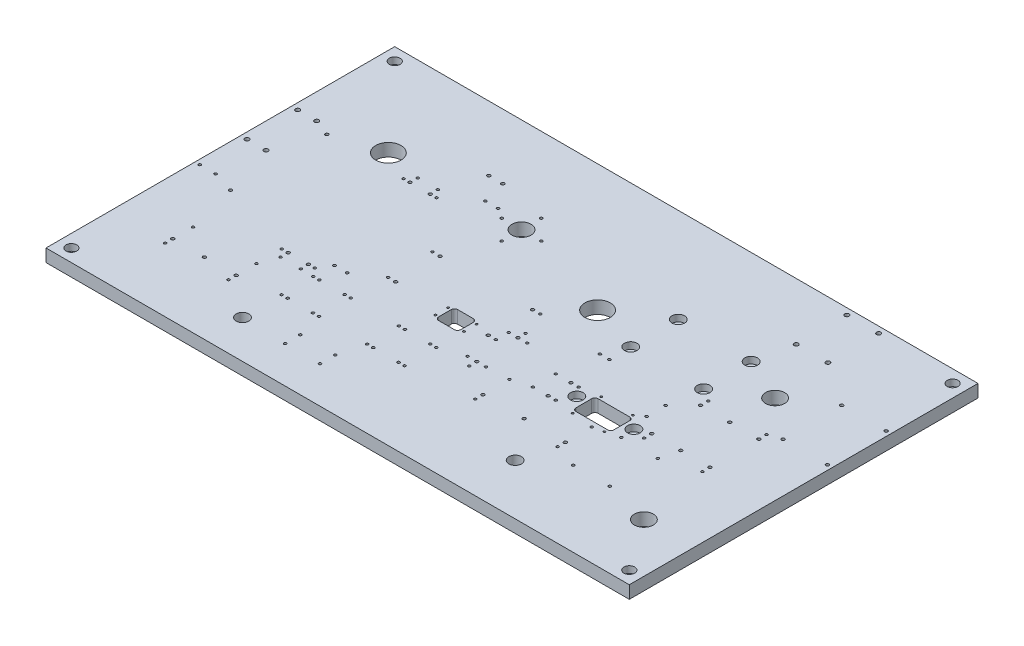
from build123d import *

# Parameters (mm, degrees)
SKETCH_1_W          = 920
SKETCH_1_H          = 20
EXTRUDE_1_DEPTH     = 550
SKETCH_2_R          = 2.1
SKETCH_2_R_2        = 2.5
SKETCH_2_R_3        = 3.25
SKETCH_2_R_4        = 3.375
SKETCH_2_R_5        = 1.65
SKETCH_2_R_6        = 15
SKETCH_2_R_7        = 2
SKETCH_2_R_8        = 5.25
SKETCH_2_R_9        = 10
SKETCH_2_R_10       = 20
CUT_EXTRUDE_2_DEPTH = 550
SKETCH_3_R          = 2
CUT_EXTRUDE_3_DEPTH = 550
SKETCH_4_R          = 8.5
CUT_EXTRUDE_4_DEPTH = 10.5
SKETCH_5_R          = 10
CUT_EXTRUDE_5_DEPTH = 10.5
SKETCH_7_R          = 5.5
SKETCH_7_R_2        = 5.456903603
CUT_EXTRUDE_6_DEPTH = 6.5


with BuildPart() as part:
    # Sketch 1 → Extrude 1 (new body)
    with BuildSketch(Plane.XY):
        with Locations((460, 10)):
            Rectangle(SKETCH_1_W, SKETCH_1_H)
    extrude(amount=EXTRUDE_1_DEPTH)

    # Sketch 2 → Cut-Extrude 2 (cut)
    with BuildSketch(Plane(origin=(0, 20, 0), x_dir=(1, 0, 0), z_dir=(0, 1, 0))):
        with Locations(Location((32.5, -315, 0), (0, 0, 270))):
            Circle(SKETCH_2_R)
        with Locations(Location((7.5, -315, 0), (0, 0, 270))):
            Circle(SKETCH_2_R)
        with Locations(Location((66.45, -325.428369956, 0), (0, 0, 270))):
            Circle(SKETCH_2_R_2)
        with Locations(Location((66.45, -173.428369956, 0), (0, 0, 270))):
            Circle(SKETCH_2_R_2)
        with Locations(Location((229.45, -173.428369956, 0), (0, 0, 270))):
            Circle(SKETCH_2_R_2)
        with Locations(Location((197.45, -173.428369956, 0), (0, 0, 270))):
            Circle(SKETCH_2_R_2)
        with Locations(Location((229.45, -365.5, 0), (0, 0, 270))):
            Circle(SKETCH_2_R_2)
        with Locations(Location((197.45, -365.5, 0), (0, 0, 270))):
            Circle(SKETCH_2_R_2)
        with Locations(Location((272.45, -102, 0), (0, 0, 270))):
            Circle(SKETCH_2_R_2)
        with Locations(Location((250.45, -102, 0), (0, 0, 270))):
            Circle(SKETCH_2_R_2)
        with Locations(Location((302.45, -139.428369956, 0), (0, 0, 270))):
            Circle(SKETCH_2_R)
        with Locations(Location((282.45, -139.428369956, 0), (0, 0, 270))):
            Circle(SKETCH_2_R)
        with Locations(Location((251.45, -346.428369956, 0), (0, 0, 270))):
            Circle(SKETCH_2_R)
        with Locations(Location((271.45, -346.428369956, 0), (0, 0, 270))):
            Circle(SKETCH_2_R)
        with Locations(Location((322, -250.5, 0), (0, 0, 270))):
            Circle(SKETCH_2_R_2)
        with Locations(Location((322, -320.5, 0), (0, 0, 270))):
            Circle(SKETCH_2_R_2)
        with Locations(Location((468, -250.5, 0), (0, 0, 270))):
            Circle(SKETCH_2_R_2)
        with Locations(Location((468, -320.5, 0), (0, 0, 270))):
            Circle(SKETCH_2_R_2)
        with Locations(Location((494.9, -300.5, 0), (0, 0, 270))):
            Circle(SKETCH_2_R_2)
        with Locations(Location((494.9, -365.5, 0), (0, 0, 270))):
            Circle(SKETCH_2_R_2)
        with Locations(Location((598, -320, 0), (0, 0, 270))):
            Circle(SKETCH_2_R_2)
        with Locations(Location((598, -356, 0), (0, 0, 270))):
            Circle(SKETCH_2_R_2)
        with Locations(Location((731.25, -248.8, 0), (0, 0, 270))):
            Circle(SKETCH_2_R_2)
        with Locations(Location((777.25, -248.8, 0), (0, 0, 270))):
            Circle(SKETCH_2_R_2)
        with Locations(Location((823.25, -248.8, 0), (0, 0, 270))):
            Circle(SKETCH_2_R_2)
        with Locations(Location((823.25, -326, 0), (0, 0, 270))):
            Circle(SKETCH_2_R_2)
        with Locations(Location((777.25, -326, 0), (0, 0, 270))):
            Circle(SKETCH_2_R_2)
        with Locations(Location((731.25, -326, 0), (0, 0, 270))):
            Circle(SKETCH_2_R_2)
        with Locations(Location((842.5, -230, 0), (0, 0, 270))):
            Circle(SKETCH_2_R_2)
        with Locations(Location((912.5, -230, 0), (0, 0, 270))):
            Circle(SKETCH_2_R_2)
        with Locations(Location((912.5, -137.5, 0), (0, 0, 270))):
            Circle(SKETCH_2_R_2)
        with Locations(Location((842.5, -137.5, 0), (0, 0, 270))):
            Circle(SKETCH_2_R_2)
        with Locations(Location((770, -355, 0), (0, 0, 270))):
            Circle(SKETCH_2_R)
        with Locations(Location((712.5, -355, 0), (0, 0, 270))):
            Circle(SKETCH_2_R)
        with Locations(Location((770, -431, 0), (0, 0, 270))):
            Circle(SKETCH_2_R)
        with Locations(Location((712.5, -431, 0), (0, 0, 270))):
            Circle(SKETCH_2_R)
        with Locations(Location((675, -406, 0), (0, 0, 270))):
            Circle(SKETCH_2_R_2)
        with Locations(Location((610, -406, 0), (0, 0, 270))):
            Circle(SKETCH_2_R_2)
        with Locations(Location((545, -406, 0), (0, 0, 270))):
            Circle(SKETCH_2_R_2)
        with Locations(Location((434.2, -428.1, 0), (0, 0, 270))):
            Circle(SKETCH_2_R)
        with Locations(Location((434.2, -378.1, 0), (0, 0, 270))):
            Circle(SKETCH_2_R)
        with Locations(Location((394.2, -378.1, 0), (0, 0, 270))):
            Circle(SKETCH_2_R)
        with Locations(Location((394.2, -428.1, 0), (0, 0, 270))):
            Circle(SKETCH_2_R)
        with Locations(Location((299.2, -378.1, 0), (0, 0, 270))):
            Circle(SKETCH_2_R)
        with Locations(Location((299.2, -428.1, 0), (0, 0, 270))):
            Circle(SKETCH_2_R)
        with Locations(Location((259.2, -428.1, 0), (0, 0, 270))):
            Circle(SKETCH_2_R)
        with Locations(Location((259.2, -378.1, 0), (0, 0, 270))):
            Circle(SKETCH_2_R)
        with Locations(Location((187.4, -437.5, 0), (0, 0, 270))):
            Circle(SKETCH_2_R_2)
        with Locations(Location((137.4, -437.5, 0), (0, 0, 270))):
            Circle(SKETCH_2_R_2)
        with Locations(Location((87.4, -437.5, 0), (0, 0, 270))):
            Circle(SKETCH_2_R_2)
        with Locations(Location((374.2, -468, 0), (0, 0, 270))):
            Circle(SKETCH_2_R)
        with Locations(Location((374.2, -492, 0), (0, 0, 270))):
            Circle(SKETCH_2_R)
        with Locations(Location((319.2, -492, 0), (0, 0, 270))):
            Circle(SKETCH_2_R)
        with Locations(Location((319.2, -468, 0), (0, 0, 270))):
            Circle(SKETCH_2_R)
        with Locations(Location((621.25, -334, 0), (0, 0, 270))):
            Circle(SKETCH_2_R_3)
        with Locations(Location((711.25, -334, 0), (0, 0, 270))):
            Circle(SKETCH_2_R_3)
        with Locations(Location((711.25, -224, 0), (0, 0, 270))):
            Circle(SKETCH_2_R_3)
        with Locations(Location((596.25, -224, 0), (0, 0, 270))):
            Circle(SKETCH_2_R_3)
        with Locations(Location((596.25, -149, 0), (0, 0, 270))):
            Circle(SKETCH_2_R_3)
        with Locations(Location((711.25, -149, 0), (0, 0, 270))):
            Circle(SKETCH_2_R_3)
        with Locations(Location((596.75, -258.081903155, 0), (0, 0, 270))):
            Circle(SKETCH_2_R)
        with Locations(Location((581.75, -258.081903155, 0), (0, 0, 270))):
            Circle(SKETCH_2_R)
        with Locations(Location((703.75, -276.5, 0), (0, 0, 270))):
            Circle(SKETCH_2_R)
        with Locations(Location((703.75, -306.5, 0), (0, 0, 270))):
            Circle(SKETCH_2_R)
        with Locations(Location((40, -163, 0), (0, 0, 270))):
            Circle(SKETCH_2_R_4)
        with Locations(Location((10, -163, 0), (0, 0, 270))):
            Circle(SKETCH_2_R_4)
        with Locations(Location((40, -243, 0), (0, 0, 270))):
            Circle(SKETCH_2_R_4)
        with Locations(Location((10, -243, 0), (0, 0, 270))):
            Circle(SKETCH_2_R_4)
        with Locations(Location((773.25, -90, 0), (0, 0, 270))):
            Circle(SKETCH_2_R_4)
        with Locations(Location((723.25, -90, 0), (0, 0, 270))):
            Circle(SKETCH_2_R_4)
        with Locations(Location((723.25, -10, 0), (0, 0, 270))):
            Circle(SKETCH_2_R_4)
        with Locations(Location((773.25, -10, 0), (0, 0, 270))):
            Circle(SKETCH_2_R_4)
        with Locations(Location((318.75, -150, 0), (0, 0, 270))):
            Circle(SKETCH_2_R)
        with Locations(Location((350, -181.25, 0), (0, 0, 270))):
            Circle(SKETCH_2_R)
        with Locations(Location((381.25, -150, 0), (0, 0, 270))):
            Circle(SKETCH_2_R)
        with Locations(Location((350, -118.75, 0), (0, 0, 270))):
            Circle(SKETCH_2_R)
        with Locations(Location((398.7, -314.5, 0), (0, 0, 270))):
            Circle(SKETCH_2_R_5)
        with Locations(Location((443.7, -314.5, 0), (0, 0, 270))):
            Circle(SKETCH_2_R_5)
        with Locations(Location((443.7, -334.5, 0), (0, 0, 270))):
            Circle(SKETCH_2_R_5)
        with Locations(Location((398.7, -334.5, 0), (0, 0, 270))):
            Circle(SKETCH_2_R_5)
        with Locations(Location((641.25, -360.5, 0), (0, 0, 270))):
            Circle(SKETCH_2_R_5)
        with Locations(Location((691.25, -360.5, 0), (0, 0, 270))):
            Circle(SKETCH_2_R_5)
        with Locations(Location((691.25, -315.5, 0), (0, 0, 270))):
            Circle(SKETCH_2_R_5)
        with Locations(Location((641.25, -315.5, 0), (0, 0, 270))):
            Circle(SKETCH_2_R_5)
        with Locations(Location((350, -150, 0), (0, 0, 270))):
            Circle(SKETCH_2_R_6)
        with Locations(Location((187.4, -405.5, 0), (0, 0, 270))):
            Circle(SKETCH_2_R_7)
        with Locations(Location((87.4, -405.5, 0), (0, 0, 270))):
            Circle(SKETCH_2_R_7)
        with Locations(Location((87.4, -449.5, 0), (0, 0, 270))):
            Circle(SKETCH_2_R_7)
        with Locations(Location((187.4, -449.5, 0), (0, 0, 270))):
            Circle(SKETCH_2_R_7)
        with Locations(Location((308.7, -378.1, 0), (0, 0, 270))):
            Circle(SKETCH_2_R_7)
        with Locations(Location((308.7, -428.1, 0), (0, 0, 270))):
            Circle(SKETCH_2_R_7)
        with Locations(Location((249.7, -428.1, 0), (0, 0, 270))):
            Circle(SKETCH_2_R_7)
        with Locations(Location((249.7, -378.1, 0), (0, 0, 270))):
            Circle(SKETCH_2_R_7)
        with Locations(Location((443.7, -428.1, 0), (0, 0, 270))):
            Circle(SKETCH_2_R_7)
        with Locations(Location((443.7, -378.1, 0), (0, 0, 270))):
            Circle(SKETCH_2_R_7)
        with Locations(Location((384.7, -378.1, 0), (0, 0, 270))):
            Circle(SKETCH_2_R_7)
        with Locations(Location((384.7, -428.1, 0), (0, 0, 270))):
            Circle(SKETCH_2_R_7)
        with Locations(Location((239.45, -365.5, 0), (0, 0, 270))):
            Circle(SKETCH_2_R_7)
        with Locations(Location((187.45, -365.5, 0), (0, 0, 270))):
            Circle(SKETCH_2_R_7)
        with Locations(Location((239.45, -173.428369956, 0), (0, 0, 270))):
            Circle(SKETCH_2_R_7)
        with Locations(Location((187.45, -173.428369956, 0), (0, 0, 270))):
            Circle(SKETCH_2_R_7)
        with Locations(Location((229.45, -377.5, 0), (0, 0, 270))):
            Circle(SKETCH_2_R_7)
        with Locations(Location((197.45, -377.5, 0), (0, 0, 270))):
            Circle(SKETCH_2_R_7)
        with Locations(Location((229.45, -161.428369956, 0), (0, 0, 270))):
            Circle(SKETCH_2_R_7)
        with Locations(Location((197.45, -161.428369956, 0), (0, 0, 270))):
            Circle(SKETCH_2_R_7)
        with Locations(Location((494.9, -288.5, 0), (0, 0, 270))):
            Circle(SKETCH_2_R_7)
        with Locations(Location((494.9, -377.5, 0), (0, 0, 270))):
            Circle(SKETCH_2_R_7)
        with Locations(Location((509.4, -300.5, 0), (0, 0, 270))):
            Circle(SKETCH_2_R_7)
        with Locations(Location((509.4, -365.5, 0), (0, 0, 270))):
            Circle(SKETCH_2_R_7)
        with Locations(Location((480.4, -365.5, 0), (0, 0, 270))):
            Circle(SKETCH_2_R_7)
        with Locations(Location((574, -356, 0), (0, 0, 270))):
            Circle(SKETCH_2_R_7)
        with Locations(Location((610, -356, 0), (0, 0, 270))):
            Circle(SKETCH_2_R_7)
        with Locations(Location((610, -320, 0), (0, 0, 270))):
            Circle(SKETCH_2_R_7)
        with Locations(Location((574, -320, 0), (0, 0, 270))):
            Circle(SKETCH_2_R_7)
        with Locations(Location((675, -418, 0), (0, 0, 270))):
            Circle(SKETCH_2_R_7)
        with Locations(Location((545, -418, 0), (0, 0, 270))):
            Circle(SKETCH_2_R_7)
        with Locations(Location((545, -364, 0), (0, 0, 270))):
            Circle(SKETCH_2_R_7)
        with Locations(Location((675, -364, 0), (0, 0, 270))):
            Circle(SKETCH_2_R_7)
        with Locations(Location((731.25, -236.8, 0), (0, 0, 270))):
            Circle(SKETCH_2_R_7)
        with Locations(Location((823.25, -236.8, 0), (0, 0, 270))):
            Circle(SKETCH_2_R_7)
        with Locations(Location((823.25, -338, 0), (0, 0, 270))):
            Circle(SKETCH_2_R_7)
        with Locations(Location((731.25, -338, 0), (0, 0, 270))):
            Circle(SKETCH_2_R_7)
        with Locations(Location((310, -320.5, 0), (0, 0, 270))):
            Circle(SKETCH_2_R_7)
        with Locations(Location((310, -250.5, 0), (0, 0, 270))):
            Circle(SKETCH_2_R_7)
        with Locations(Location((480, -250.5, 0), (0, 0, 270))):
            Circle(SKETCH_2_R_7)
        with Locations(Location((480, -320.5, 0), (0, 0, 270))):
            Circle(SKETCH_2_R_7)
        with Locations(Location((20, -530, 0), (0, 0, 270))):
            Circle(SKETCH_2_R_8)
        with Locations(Location((20, -20, 0), (0, 0, 270))):
            Circle(SKETCH_2_R_8)
        with Locations(Location((900, -20, 0), (0, 0, 270))):
            Circle(SKETCH_2_R_8)
        with Locations(Location((900, -530, 0), (0, 0, 270))):
            Circle(SKETCH_2_R_8)
        with Locations(Location((250, -490, 0), (0, 0, 270))):
            Circle(SKETCH_2_R_9)
        with Locations(Location((140, -150, 0), (0, 0, 270))):
            Circle(SKETCH_2_R_10)
        with Locations(Location((520, -200, 0), (0, 0, 270))):
            Circle(SKETCH_2_R_10)
        with Locations(Location((780, -180, 0), (0, 0, 270))):
            Circle(SKETCH_2_R_6)
        with Locations(Location((660, -470, 0), (0, 0, 270))):
            Circle(SKETCH_2_R_9)
        with Locations(Location((842.5, -449.5, 0), (0, 0, 270))):
            Circle(SKETCH_2_R_6)
        with BuildLine():
            Line((641.25, -355.5), (691.25, -355.5))
            ThreePointArc((691.25, -355.5), (694.785533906, -354.035533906), (696.25, -350.5))
            Line((696.25, -350.5), (696.25, -325.5))
            ThreePointArc((696.25, -325.5), (694.785533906, -321.964466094), (691.25, -320.5))
            Line((691.25, -320.5), (641.25, -320.5))
            ThreePointArc((641.25, -320.5), (637.714466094, -321.964466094), (636.25, -325.5))
            Line((636.25, -325.5), (636.25, -350.5))
            ThreePointArc((636.25, -350.5), (637.714466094, -354.035533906), (641.25, -355.5))
        make_face()
        with BuildLine():
            Line((408.7, -309.5), (433.7, -309.5))
            ThreePointArc((433.7, -309.5), (437.235533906, -310.964466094), (438.7, -314.5))
            Line((438.7, -314.5), (438.7, -334.5))
            ThreePointArc((438.7, -334.5), (437.235533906, -338.035533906), (433.7, -339.5))
            Line((433.7, -339.5), (408.7, -339.5))
            ThreePointArc((408.7, -339.5), (405.164466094, -338.035533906), (403.7, -334.5))
            Line((403.7, -334.5), (403.7, -314.5))
            ThreePointArc((403.7, -314.5), (405.164466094, -310.964466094), (408.7, -309.5))
        make_face()
    extrude(amount=-CUT_EXTRUDE_2_DEPTH, mode=Mode.SUBTRACT)

    # Sketch 3 → Cut-Extrude 3 (cut)
    with BuildSketch(Plane(origin=(0, 20, 0), x_dir=(1, 0, 0), z_dir=(0, 1, 0))):
        with Locations(Location((480.4, -300.5, 0), (0, 0, 270))):
            Circle(SKETCH_3_R)
    extrude(amount=-CUT_EXTRUDE_3_DEPTH, mode=Mode.SUBTRACT)

    # Sketch 4 → Cut-Extrude 4 (cut)
    with BuildSketch(Plane(origin=(0, 20, 0), x_dir=(1, 0, 0), z_dir=(0, 1, 0))):
        with Locations(Location((20, -530, 0), (0, 0, 270))):
            Circle(SKETCH_4_R)
        with Locations(Location((20, -20, 0), (0, 0, 270))):
            Circle(SKETCH_4_R)
        with Locations(Location((900, -20, 0), (0, 0, 270))):
            Circle(SKETCH_4_R)
        with Locations(Location((900, -530, 0), (0, 0, 270))):
            Circle(SKETCH_4_R)
    extrude(amount=-CUT_EXTRUDE_4_DEPTH, mode=Mode.SUBTRACT)

    # Sketch 5 → Cut-Extrude 5 (cut)
    with BuildSketch(Plane(origin=(0, 20, 0), x_dir=(1, 0, 0), z_dir=(0, 1, 0))):
        with Locations(Location((596.25, -149, 0), (0, 0, 270))):
            Circle(SKETCH_5_R)
        with Locations(Location((711.25, -149, 0), (0, 0, 270))):
            Circle(SKETCH_5_R)
        with Locations(Location((711.25, -224, 0), (0, 0, 270))):
            Circle(SKETCH_5_R)
        with Locations(Location((596.25, -224, 0), (0, 0, 270))):
            Circle(SKETCH_5_R)
        with Locations(Location((621.25, -334, 0), (0, 0, 270))):
            Circle(SKETCH_5_R)
        with Locations(Location((711.25, -334, 0), (0, 0, 270))):
            Circle(SKETCH_5_R)
    extrude(amount=-CUT_EXTRUDE_5_DEPTH, mode=Mode.SUBTRACT)

    # Sketch 7 → Cut-Extrude 6 (cut)
    with BuildSketch(Plane.XZ):
        with Locations(Location((621.25, 334, 0), (0, 0, 270))):
            Circle(SKETCH_7_R)
        with Locations(Location((711.25, 334, 0), (0, 0, 270))):
            Circle(SKETCH_7_R)
        with Locations(Location((711.25, 224, 0), (0, 0, 270))):
            Circle(SKETCH_7_R)
        with Locations(Location((596.25, 224, 0), (0, 0, 270))):
            Circle(SKETCH_7_R_2)
        with Locations(Location((596.25, 149, 0), (0, 0, 270))):
            Circle(SKETCH_7_R)
        with Locations(Location((711.25, 149, 0), (0, 0, 270))):
            Circle(SKETCH_7_R)
    extrude(amount=-CUT_EXTRUDE_6_DEPTH, mode=Mode.SUBTRACT)


solid = part.part
